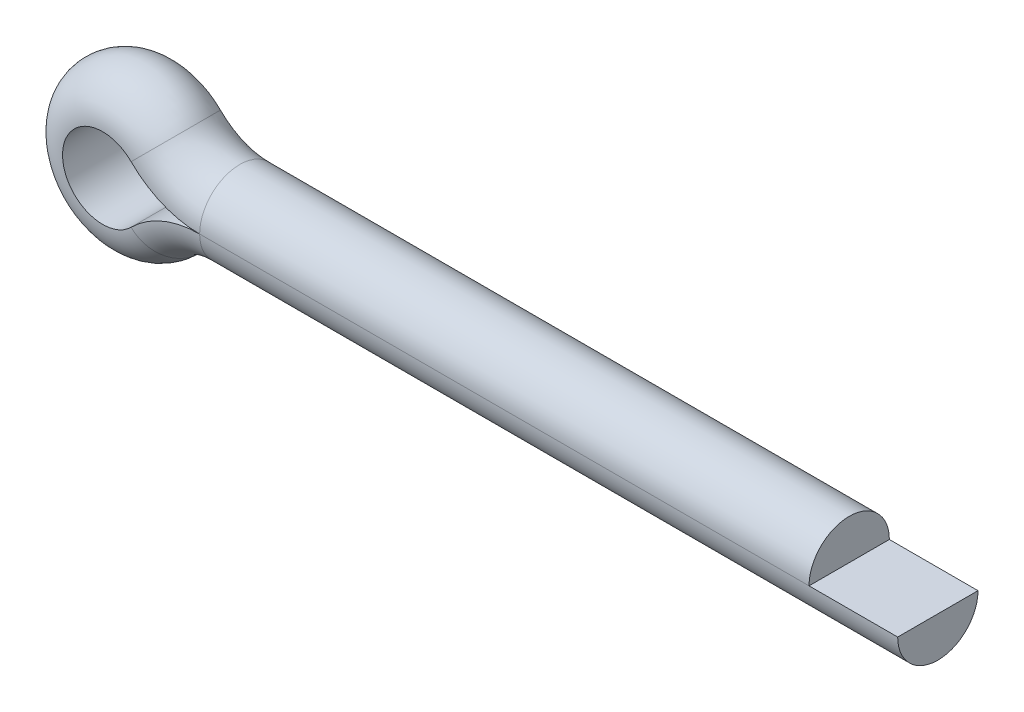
from build123d import *


with BuildPart() as part:
    # Body: sweep along a path in PathSke
    with BuildLine(Plane(origin=(1.207969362, 1.807969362, 0), x_dir=(0, 1, 0), z_dir=(0, 0, 1))) as body_path:
        Line((-0.357969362, -27.192030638), (-0.357969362, -5.192030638))
        ThreePointArc((-0.357969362, -5.192030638), (-0.201939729, -4.407742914), (0.242387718, -3.742892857))
        ThreePointArc((0.242387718, -3.742892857), (-1.807969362, 1.207969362), (-3.858326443, -3.742892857))
        ThreePointArc((-3.858326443, -3.742892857), (-3.413998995, -4.407742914), (-3.257969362, -5.192030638))
        Line((-3.257969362, -5.192030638), (-3.257969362, -30.392030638))
    # SectionSke → Body (sweep)
    with BuildSketch(Plane(origin=(28.4, 0.15, 0.15), x_dir=(0, 1, 0), z_dir=(1, 0, 0))):
        with BuildLine():
            Line((-0.15, -1.6), (-0.15, 1.3))
            ThreePointArc((-0.15, 1.3), (1.3, -0.15), (-0.15, -1.6))
        make_face()
    sweep(path=body_path.line)


solid = part.part
